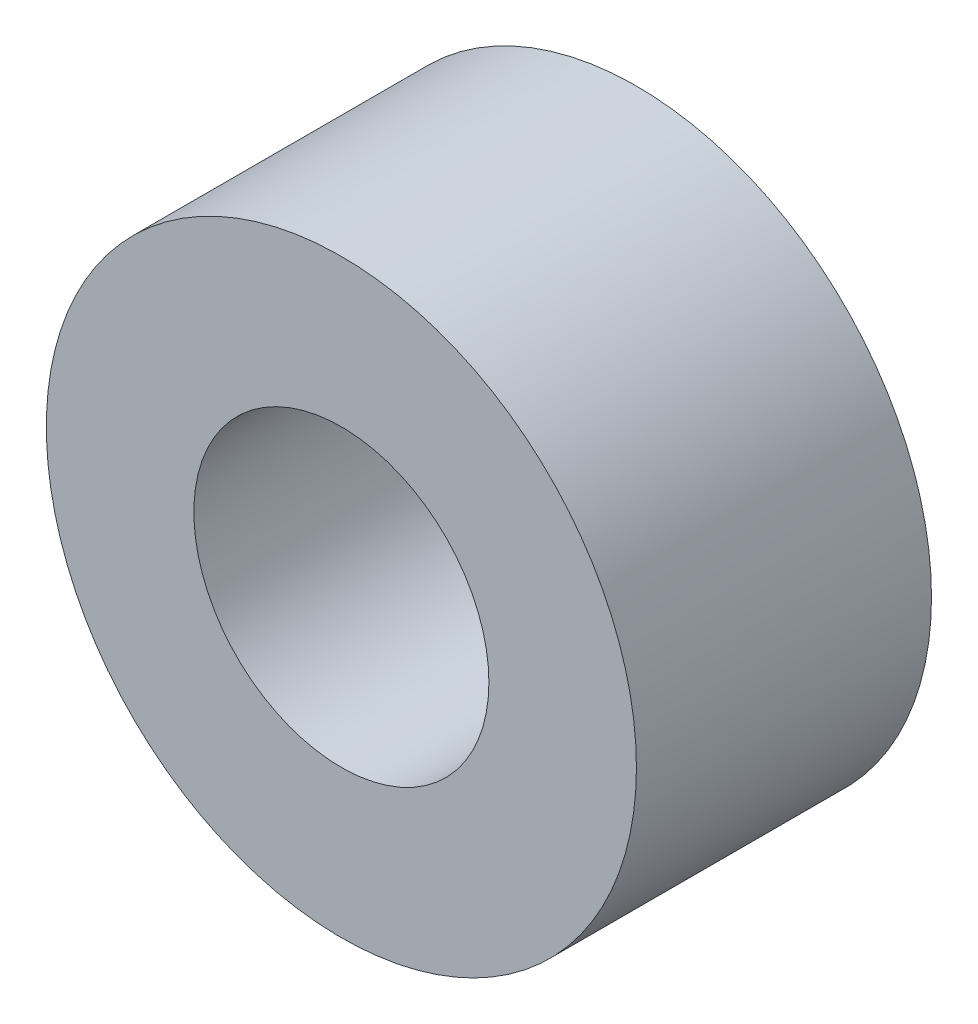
ISO-10303-21;
HEADER;
FILE_DESCRIPTION(('STEP AP214'),'2;1');
FILE_NAME('part.step','',(''),(''),'','','');
FILE_SCHEMA(('AUTOMOTIVE_DESIGN { 1 0 10303 214 1 1 1 1 }'));
ENDSEC;
DATA;
#1=APPLICATION_CONTEXT('core data for automotive mechanical design processes');
#2=APPLICATION_PROTOCOL_DEFINITION('international standard','automotive_design',2000,#1);
#3=PRODUCT_CONTEXT('',#1,'mechanical');
#4=PRODUCT('Part','Part','',(#3));
#5=PRODUCT_RELATED_PRODUCT_CATEGORY('part','',(#4));
#6=PRODUCT_DEFINITION_FORMATION('','',#4);
#7=PRODUCT_DEFINITION_CONTEXT('part definition',#1,'design');
#8=PRODUCT_DEFINITION('design','',#6,#7);
#9=PRODUCT_DEFINITION_SHAPE('','',#8);
#10=(LENGTH_UNIT() NAMED_UNIT(*) SI_UNIT(.MILLI.,.METRE.));
#11=(NAMED_UNIT(*) PLANE_ANGLE_UNIT() SI_UNIT($,.RADIAN.));
#12=(NAMED_UNIT(*) SI_UNIT($,.STERADIAN.) SOLID_ANGLE_UNIT());
#13=UNCERTAINTY_MEASURE_WITH_UNIT(LENGTH_MEASURE(1.E-05),#10,'distance_accuracy_value','');
#14=(GEOMETRIC_REPRESENTATION_CONTEXT(3) GLOBAL_UNCERTAINTY_ASSIGNED_CONTEXT((#13)) GLOBAL_UNIT_ASSIGNED_CONTEXT((#10,
#11,#12)) REPRESENTATION_CONTEXT('',''));
#15=CARTESIAN_POINT('',(0.,0.,0.));
#16=DIRECTION('',(0.,0.,1.));
#17=DIRECTION('',(1.,0.,0.));
#18=AXIS2_PLACEMENT_3D('',#15,#16,#17);
#19=CARTESIAN_POINT('',(0.,0.,20.));
#20=DIRECTION('',(0.,0.,1.));
#21=DIRECTION('',(1.,0.,0.));
#22=AXIS2_PLACEMENT_3D('',#19,#20,#21);
#23=PLANE('',#22);
#24=CARTESIAN_POINT('',(0.,0.,20.));
#25=DIRECTION('',(0.,0.,1.));
#26=DIRECTION('',(1.,0.,0.));
#27=AXIS2_PLACEMENT_3D('',#24,#25,#26);
#28=CIRCLE('',#27,20.);
#29=CARTESIAN_POINT('',(20.,0.,20.));
#30=VERTEX_POINT('',#29);
#31=EDGE_CURVE('E10',#30,#30,#28,.T.);
#32=ORIENTED_EDGE('',*,*,#31,.T.);
#33=EDGE_LOOP('',(#32));
#34=FACE_BOUND('',#33,.T.);
#35=CARTESIAN_POINT('',(0.,0.,20.));
#36=DIRECTION('',(0.,0.,1.));
#37=DIRECTION('',(1.,0.,0.));
#38=AXIS2_PLACEMENT_3D('',#35,#36,#37);
#39=CIRCLE('',#38,10.);
#40=CARTESIAN_POINT('',(10.,0.,20.));
#41=VERTEX_POINT('',#40);
#42=EDGE_CURVE('E40',#41,#41,#39,.T.);
#43=ORIENTED_EDGE('',*,*,#42,.F.);
#44=EDGE_LOOP('',(#43));
#45=FACE_BOUND('',#44,.T.);
#46=ADVANCED_FACE('F29',(#34,#45),#23,.T.);
#47=CARTESIAN_POINT('',(0.,0.,0.));
#48=DIRECTION('',(0.,0.,1.));
#49=DIRECTION('',(1.,0.,0.));
#50=AXIS2_PLACEMENT_3D('',#47,#48,#49);
#51=PLANE('',#50);
#52=CARTESIAN_POINT('',(0.,0.,0.));
#53=DIRECTION('',(0.,0.,1.));
#54=DIRECTION('',(1.,0.,0.));
#55=AXIS2_PLACEMENT_3D('',#52,#53,#54);
#56=CIRCLE('',#55,20.);
#57=CARTESIAN_POINT('',(20.,0.,0.));
#58=VERTEX_POINT('',#57);
#59=EDGE_CURVE('E33',#58,#58,#56,.T.);
#60=ORIENTED_EDGE('',*,*,#59,.F.);
#61=EDGE_LOOP('',(#60));
#62=FACE_BOUND('',#61,.T.);
#63=CARTESIAN_POINT('',(0.,0.,0.));
#64=DIRECTION('',(0.,0.,1.));
#65=DIRECTION('',(1.,0.,0.));
#66=AXIS2_PLACEMENT_3D('',#63,#64,#65);
#67=CIRCLE('',#66,10.);
#68=CARTESIAN_POINT('',(10.,0.,0.));
#69=VERTEX_POINT('',#68);
#70=EDGE_CURVE('E42',#69,#69,#67,.T.);
#71=ORIENTED_EDGE('',*,*,#70,.T.);
#72=EDGE_LOOP('',(#71));
#73=FACE_BOUND('',#72,.T.);
#74=ADVANCED_FACE('F52',(#62,#73),#51,.F.);
#75=CARTESIAN_POINT('',(0.,0.,20.));
#76=DIRECTION('',(0.,0.,-1.));
#77=DIRECTION('',(-1.,0.,0.));
#78=AXIS2_PLACEMENT_3D('',#75,#76,#77);
#79=CYLINDRICAL_SURFACE('',#78,20.);
#80=ORIENTED_EDGE('',*,*,#31,.F.);
#81=EDGE_LOOP('',(#80));
#82=FACE_BOUND('',#81,.T.);
#83=ORIENTED_EDGE('',*,*,#59,.T.);
#84=EDGE_LOOP('',(#83));
#85=FACE_BOUND('',#84,.T.);
#86=ADVANCED_FACE('F31',(#82,#85),#79,.T.);
#87=CARTESIAN_POINT('',(0.,0.,20.));
#88=DIRECTION('',(0.,0.,-1.));
#89=DIRECTION('',(-1.,0.,0.));
#90=AXIS2_PLACEMENT_3D('',#87,#88,#89);
#91=CYLINDRICAL_SURFACE('',#90,10.);
#92=ORIENTED_EDGE('',*,*,#42,.T.);
#93=EDGE_LOOP('',(#92));
#94=FACE_BOUND('',#93,.T.);
#95=ORIENTED_EDGE('',*,*,#70,.F.);
#96=EDGE_LOOP('',(#95));
#97=FACE_BOUND('',#96,.T.);
#98=ADVANCED_FACE('F48',(#94,#97),#91,.F.);
#99=CLOSED_SHELL('',(#46,#74,#86,#98));
#100=MANIFOLD_SOLID_BREP('B2',#99);
#101=ADVANCED_BREP_SHAPE_REPRESENTATION('',(#18,#100),#14);
#102=SHAPE_DEFINITION_REPRESENTATION(#9,#101);
ENDSEC;
END-ISO-10303-21;
